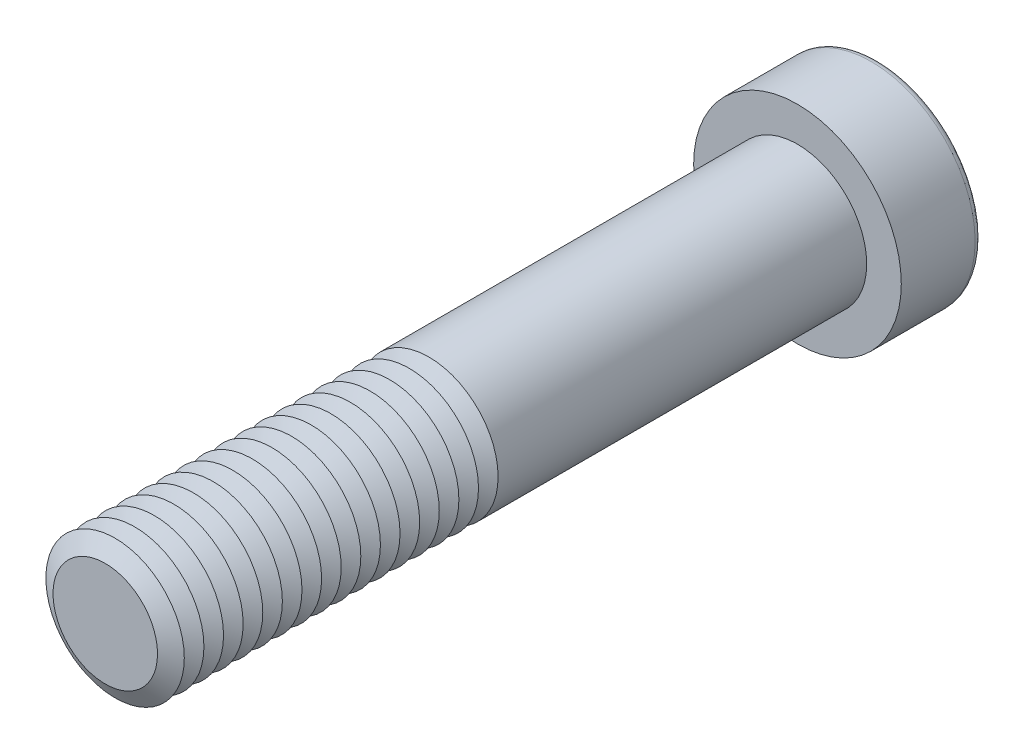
from build123d import *

# Parameters (mm, degrees)
SKETCH1_R           = 6
BOSS_EXTRUDE1_DEPTH = 60
SKETCH2_R           = 9
BOSS_EXTRUDE2_DEPTH = 7
CUT_EXTRUDE1_DEPTH  = 6
FILLET1_R           = 0.6
LPATTERN1_COUNT     = 17
LPATTERN1_PITCH     = 1.7


with BuildPart() as part:
    # Sketch1 → Boss-Extrude1 (new body)
    with BuildSketch(Plane.XY):
        Circle(SKETCH1_R)
    extrude(amount=BOSS_EXTRUDE1_DEPTH)

    # Sketch2 → Boss-Extrude2 (add)
    with BuildSketch(Plane(origin=(0, 0, 0), x_dir=(-1, 0, 0), z_dir=(0, 0, -1))):
        Circle(SKETCH2_R)
    extrude(amount=BOSS_EXTRUDE2_DEPTH)

    # Sketch3 → Cut-Extrude1 (cut)
    with BuildSketch(Plane(origin=(0, 0, -7), x_dir=(-1, 0, 0), z_dir=(0, 0, -1))):
        Polygon((-2.309401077, 4), (-4.618802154, 0), (-2.309401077, -4), (2.309401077, -4), (4.618802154, 0), (2.309401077, 4), align=None)
    extrude(amount=-CUT_EXTRUDE1_DEPTH, mode=Mode.SUBTRACT)

    # Fillet1
    fillet1_edges = [part.edges().sort_by_distance(p)[0] for p in [
        (9, 0, -7),
    ]]
    fillet(fillet1_edges, radius=FILLET1_R)

    # Cut-Extrude2 cone 1 section (on through the dimple's axis) → Cut-Extrude2 (revolve, cut)
    with BuildSketch(Plane(origin=(0, 0, -1), x_dir=(0, 1, 0), z_dir=(1, 0, 0))):
        Polygon((0, 0), (4, 0), (0, 2.309401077), align=None)
    revolve(axis=Axis((0, 0, -1), (0, 0, 1)), mode=Mode.SUBTRACT)

    # Cut-Extrude3 cone 1 section (on through the dimple's axis) → Cut-Extrude3 (revolve, cut)
    with BuildSketch(Plane(origin=(0, 0, -7), x_dir=(0, 1, 0), z_dir=(1, 0, 0))):
        Polygon((0, 0), (4.618802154, 0), (0, 1.237604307), align=None)
    revolve(axis=Axis((0, 0, -7), (0, 0, 1)), mode=Mode.SUBTRACT)

    # Sketch7 → Cut-Revolve1 (revolve, cut)
    with BuildSketch(Plane(origin=(0, 0, 0), x_dir=(0, 0, -1), z_dir=(1, 0, 0)), mode=Mode.PRIVATE) as cut_revolve1_sk:
        Polygon((-60, 4.527756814), (-59.15, 6), (-60.85, 6), align=None)
    cut_revolve1 = revolve(cut_revolve1_sk.sketch.rotate(Axis((0, 0, 60), (0, 0, -1)), 90), axis=Axis((0, 0, 60), (0, 0, -1)), mode=Mode.SUBTRACT)

    # LPattern1: Cut-Revolve1 ×17
    with Locations(*[(0, 0, -i * LPATTERN1_PITCH) for i in range(1, LPATTERN1_COUNT)]):
        add(cut_revolve1, mode=Mode.SUBTRACT)


solid = part.part
